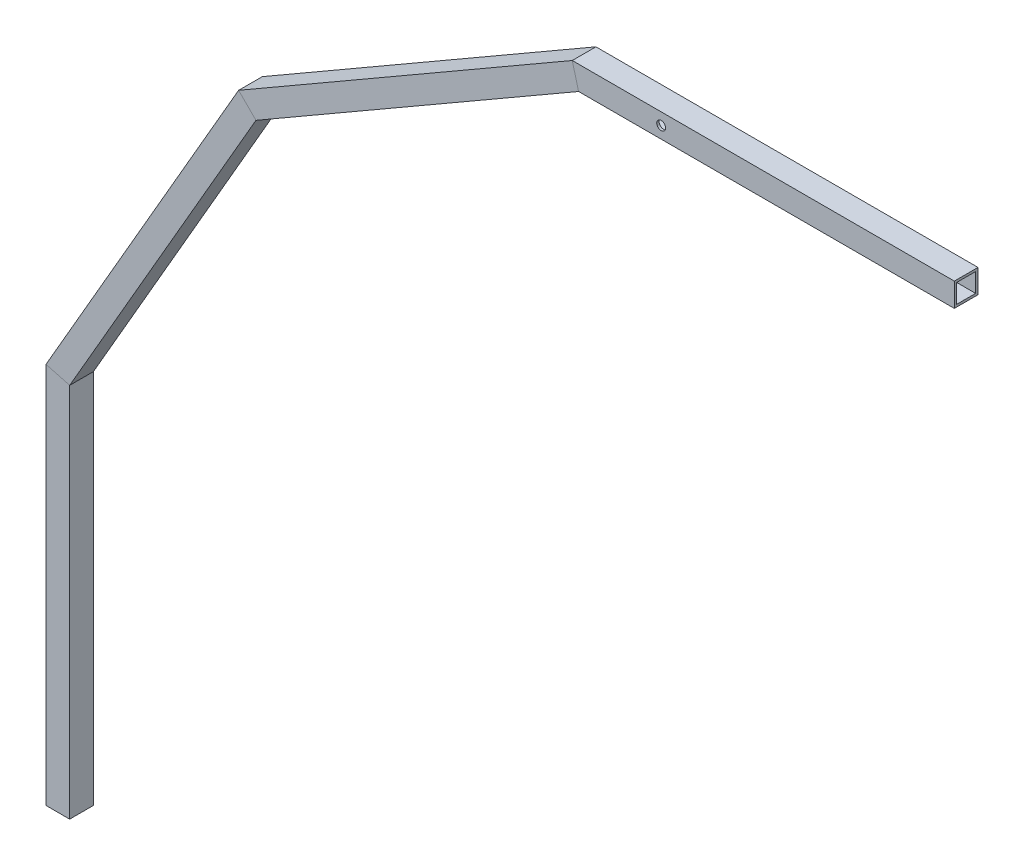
ISO-10303-21;
HEADER;
FILE_DESCRIPTION(('STEP AP214'),'2;1');
FILE_NAME('part.step','',(''),(''),'','','');
FILE_SCHEMA(('AUTOMOTIVE_DESIGN { 1 0 10303 214 1 1 1 1 }'));
ENDSEC;
DATA;
#1=APPLICATION_CONTEXT('core data for automotive mechanical design processes');
#2=APPLICATION_PROTOCOL_DEFINITION('international standard','automotive_design',2000,#1);
#3=PRODUCT_CONTEXT('',#1,'mechanical');
#4=PRODUCT('Part','Part','',(#3));
#5=PRODUCT_RELATED_PRODUCT_CATEGORY('part','',(#4));
#6=PRODUCT_DEFINITION_FORMATION('','',#4);
#7=PRODUCT_DEFINITION_CONTEXT('part definition',#1,'design');
#8=PRODUCT_DEFINITION('design','',#6,#7);
#9=PRODUCT_DEFINITION_SHAPE('','',#8);
#10=(LENGTH_UNIT() NAMED_UNIT(*) SI_UNIT(.MILLI.,.METRE.));
#11=(NAMED_UNIT(*) PLANE_ANGLE_UNIT() SI_UNIT($,.RADIAN.));
#12=(NAMED_UNIT(*) SI_UNIT($,.STERADIAN.) SOLID_ANGLE_UNIT());
#13=UNCERTAINTY_MEASURE_WITH_UNIT(LENGTH_MEASURE(1.E-05),#10,'distance_accuracy_value','');
#14=(GEOMETRIC_REPRESENTATION_CONTEXT(3) GLOBAL_UNCERTAINTY_ASSIGNED_CONTEXT((#13)) GLOBAL_UNIT_ASSIGNED_CONTEXT((#10,
#11,#12)) REPRESENTATION_CONTEXT('',''));
#15=CARTESIAN_POINT('',(0.,0.,0.));
#16=DIRECTION('',(0.,0.,1.));
#17=DIRECTION('',(1.,0.,0.));
#18=AXIS2_PLACEMENT_3D('',#15,#16,#17);
#19=CARTESIAN_POINT('',(551.309473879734,974.252724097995,-12.7));
#20=DIRECTION('',(0.,1.,0.));
#21=DIRECTION('',(-1.,0.,0.));
#22=AXIS2_PLACEMENT_3D('',#19,#20,#21);
#23=PLANE('',#22);
#24=DIRECTION('',(0.,0.,-1.));
#25=VECTOR('',#24,1.);
#26=CARTESIAN_POINT('',(551.749769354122,974.252724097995,-12.7));
#27=LINE('',#26,#25);
#28=CARTESIAN_POINT('',(551.749769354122,974.252724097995,12.7));
#29=VERTEX_POINT('',#28);
#30=CARTESIAN_POINT('',(551.749769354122,974.252724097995,-12.7));
#31=VERTEX_POINT('',#30);
#32=EDGE_CURVE('E200',#29,#31,#27,.T.);
#33=ORIENTED_EDGE('',*,*,#32,.F.);
#34=DIRECTION('',(1.,0.,0.));
#35=VECTOR('',#34,1.);
#36=CARTESIAN_POINT('',(551.309473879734,974.252724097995,12.7));
#37=LINE('',#36,#35);
#38=CARTESIAN_POINT('',(961.552724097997,974.252724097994,12.7));
#39=VERTEX_POINT('',#38);
#40=EDGE_CURVE('E165',#29,#39,#37,.T.);
#41=ORIENTED_EDGE('',*,*,#40,.T.);
#42=DIRECTION('',(0.,0.,1.));
#43=VECTOR('',#42,1.);
#44=CARTESIAN_POINT('',(961.552724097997,974.252724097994,-12.7));
#45=LINE('',#44,#43);
#46=CARTESIAN_POINT('',(961.552724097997,974.252724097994,-12.7));
#47=VERTEX_POINT('',#46);
#48=EDGE_CURVE('E216',#47,#39,#45,.T.);
#49=ORIENTED_EDGE('',*,*,#48,.F.);
#50=DIRECTION('',(1.,0.,0.));
#51=VECTOR('',#50,1.);
#52=CARTESIAN_POINT('',(551.309473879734,974.252724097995,-12.7));
#53=LINE('',#52,#51);
#54=EDGE_CURVE('E194',#31,#47,#53,.T.);
#55=ORIENTED_EDGE('',*,*,#54,.F.);
#56=EDGE_LOOP('',(#33,#41,#49,#55));
#57=FACE_BOUND('',#56,.T.);
#58=ADVANCED_FACE('F33',(#57),#23,.T.);
#59=CARTESIAN_POINT('',(551.309473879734,948.852724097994,12.7));
#60=DIRECTION('',(0.,0.,1.));
#61=DIRECTION('',(0.,-1.,0.));
#62=AXIS2_PLACEMENT_3D('',#59,#60,#61);
#63=PLANE('',#62);
#64=CARTESIAN_POINT('',(647.126769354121,961.552724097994,12.6999999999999));
#65=DIRECTION('',(0.,0.,1.));
#66=DIRECTION('',(1.,0.,0.));
#67=AXIS2_PLACEMENT_3D('',#64,#65,#66);
#68=CIRCLE('',#67,4.76250000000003);
#69=CARTESIAN_POINT('',(651.889269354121,961.552724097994,12.6999999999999));
#70=VERTEX_POINT('',#69);
#71=EDGE_CURVE('E401',#70,#70,#68,.T.);
#72=ORIENTED_EDGE('',*,*,#71,.F.);
#73=EDGE_LOOP('',(#72));
#74=FACE_BOUND('',#73,.T.);
#75=DIRECTION('',(-0.258819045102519,0.965925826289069,0.));
#76=VECTOR('',#75,1.);
#77=CARTESIAN_POINT('',(585.808810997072,847.142650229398,12.7));
#78=LINE('',#77,#76);
#79=CARTESIAN_POINT('',(558.555678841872,948.852724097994,12.7));
#80=VERTEX_POINT('',#79);
#81=EDGE_CURVE('E160',#80,#29,#78,.T.);
#82=ORIENTED_EDGE('',*,*,#81,.F.);
#83=DIRECTION('',(1.,0.,0.));
#84=VECTOR('',#83,1.);
#85=CARTESIAN_POINT('',(551.309473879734,948.852724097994,12.7));
#86=LINE('',#85,#84);
#87=CARTESIAN_POINT('',(961.552724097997,948.852724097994,12.7));
#88=VERTEX_POINT('',#87);
#89=EDGE_CURVE('E162',#80,#88,#86,.T.);
#90=ORIENTED_EDGE('',*,*,#89,.T.);
#91=DIRECTION('',(0.,-1.,0.));
#92=VECTOR('',#91,1.);
#93=CARTESIAN_POINT('',(961.552724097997,948.852724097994,12.7));
#94=LINE('',#93,#92);
#95=EDGE_CURVE('E221',#39,#88,#94,.T.);
#96=ORIENTED_EDGE('',*,*,#95,.F.);
#97=ORIENTED_EDGE('',*,*,#40,.F.);
#98=EDGE_LOOP('',(#82,#90,#96,#97));
#99=FACE_BOUND('',#98,.T.);
#100=ADVANCED_FACE('F161',(#74,#99),#63,.T.);
#101=CARTESIAN_POINT('',(551.309473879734,948.852724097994,-12.7));
#102=DIRECTION('',(0.,-1.,0.));
#103=DIRECTION('',(1.,0.,0.));
#104=AXIS2_PLACEMENT_3D('',#101,#102,#103);
#105=PLANE('',#104);
#106=DIRECTION('',(0.,0.,1.));
#107=VECTOR('',#106,1.);
#108=CARTESIAN_POINT('',(558.555678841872,948.852724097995,-12.7));
#109=LINE('',#108,#107);
#110=CARTESIAN_POINT('',(558.555678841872,948.852724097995,-12.7));
#111=VERTEX_POINT('',#110);
#112=EDGE_CURVE('E153',#111,#80,#109,.T.);
#113=ORIENTED_EDGE('',*,*,#112,.F.);
#114=DIRECTION('',(1.,0.,0.));
#115=VECTOR('',#114,1.);
#116=CARTESIAN_POINT('',(551.309473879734,948.852724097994,-12.7));
#117=LINE('',#116,#115);
#118=CARTESIAN_POINT('',(961.552724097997,948.852724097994,-12.7));
#119=VERTEX_POINT('',#118);
#120=EDGE_CURVE('E175',#111,#119,#117,.T.);
#121=ORIENTED_EDGE('',*,*,#120,.T.);
#122=DIRECTION('',(0.,0.,-1.));
#123=VECTOR('',#122,1.);
#124=CARTESIAN_POINT('',(961.552724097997,948.852724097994,-12.7));
#125=LINE('',#124,#123);
#126=EDGE_CURVE('E174',#88,#119,#125,.T.);
#127=ORIENTED_EDGE('',*,*,#126,.F.);
#128=ORIENTED_EDGE('',*,*,#89,.F.);
#129=EDGE_LOOP('',(#113,#121,#127,#128));
#130=FACE_BOUND('',#129,.T.);
#131=ADVANCED_FACE('F172',(#130),#105,.T.);
#132=CARTESIAN_POINT('',(551.309473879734,948.852724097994,-12.7));
#133=DIRECTION('',(0.,0.,-1.));
#134=DIRECTION('',(0.,1.,0.));
#135=AXIS2_PLACEMENT_3D('',#132,#133,#134);
#136=PLANE('',#135);
#137=CARTESIAN_POINT('',(647.126769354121,961.552724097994,-12.7));
#138=DIRECTION('',(0.,0.,1.));
#139=DIRECTION('',(1.,0.,0.));
#140=AXIS2_PLACEMENT_3D('',#137,#138,#139);
#141=CIRCLE('',#140,4.76250000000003);
#142=CARTESIAN_POINT('',(651.889269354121,961.552724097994,-12.7));
#143=VERTEX_POINT('',#142);
#144=EDGE_CURVE('E404',#143,#143,#141,.T.);
#145=ORIENTED_EDGE('',*,*,#144,.T.);
#146=EDGE_LOOP('',(#145));
#147=FACE_BOUND('',#146,.T.);
#148=DIRECTION('',(0.258819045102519,-0.965925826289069,0.));
#149=VECTOR('',#148,1.);
#150=CARTESIAN_POINT('',(585.808810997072,847.142650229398,-12.7));
#151=LINE('',#150,#149);
#152=EDGE_CURVE('E185',#31,#111,#151,.T.);
#153=ORIENTED_EDGE('',*,*,#152,.F.);
#154=ORIENTED_EDGE('',*,*,#54,.T.);
#155=DIRECTION('',(0.,1.,0.));
#156=VECTOR('',#155,1.);
#157=CARTESIAN_POINT('',(961.552724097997,948.852724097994,-12.7));
#158=LINE('',#157,#156);
#159=EDGE_CURVE('E209',#119,#47,#158,.T.);
#160=ORIENTED_EDGE('',*,*,#159,.F.);
#161=ORIENTED_EDGE('',*,*,#120,.F.);
#162=EDGE_LOOP('',(#153,#154,#160,#161));
#163=FACE_BOUND('',#162,.T.);
#164=ADVANCED_FACE('F35',(#147,#163),#136,.T.);
#165=CARTESIAN_POINT('',(206.221647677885,745.432576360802,-12.7));
#166=DIRECTION('',(0.,0.,-1.));
#167=DIRECTION('',(0.,1.,0.));
#168=AXIS2_PLACEMENT_3D('',#165,#166,#167);
#169=PLANE('',#168);
#170=DIRECTION('',(0.86602540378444,0.499999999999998,0.));
#171=VECTOR('',#170,1.);
#172=CARTESIAN_POINT('',(193.521647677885,767.429621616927,-12.7));
#173=LINE('',#172,#171);
#174=CARTESIAN_POINT('',(193.902954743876,767.64976935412,-12.7));
#175=VERTEX_POINT('',#174);
#176=EDGE_CURVE('E192',#175,#31,#173,.T.);
#177=ORIENTED_EDGE('',*,*,#176,.T.);
#178=ORIENTED_EDGE('',*,*,#152,.T.);
#179=DIRECTION('',(0.86602540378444,0.499999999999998,0.));
#180=VECTOR('',#179,1.);
#181=CARTESIAN_POINT('',(206.221647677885,745.432576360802,-12.7));
#182=LINE('',#181,#180);
#183=CARTESIAN_POINT('',(212.497045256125,749.055678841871,-12.7));
#184=VERTEX_POINT('',#183);
#185=EDGE_CURVE('E184',#184,#111,#182,.T.);
#186=ORIENTED_EDGE('',*,*,#185,.F.);
#187=DIRECTION('',(0.707106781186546,-0.707106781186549,0.));
#188=VECTOR('',#187,1.);
#189=CARTESIAN_POINT('',(286.953986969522,674.598737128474,-12.7));
#190=LINE('',#189,#188);
#191=EDGE_CURVE('E256',#175,#184,#190,.T.);
#192=ORIENTED_EDGE('',*,*,#191,.F.);
#193=EDGE_LOOP('',(#177,#178,#186,#192));
#194=FACE_BOUND('',#193,.T.);
#195=ADVANCED_FACE('F273',(#194),#169,.T.);
#196=CARTESIAN_POINT('',(206.221647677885,745.432576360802,-12.7));
#197=DIRECTION('',(0.499999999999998,-0.86602540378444,0.));
#198=DIRECTION('',(0.86602540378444,0.499999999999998,0.));
#199=AXIS2_PLACEMENT_3D('',#196,#197,#198);
#200=PLANE('',#199);
#201=ORIENTED_EDGE('',*,*,#185,.T.);
#202=ORIENTED_EDGE('',*,*,#112,.T.);
#203=DIRECTION('',(0.86602540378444,0.499999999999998,0.));
#204=VECTOR('',#203,1.);
#205=CARTESIAN_POINT('',(206.221647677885,745.432576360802,12.7));
#206=LINE('',#205,#204);
#207=CARTESIAN_POINT('',(212.497045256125,749.055678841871,12.7));
#208=VERTEX_POINT('',#207);
#209=EDGE_CURVE('E181',#208,#80,#206,.T.);
#210=ORIENTED_EDGE('',*,*,#209,.F.);
#211=DIRECTION('',(0.,0.,1.));
#212=VECTOR('',#211,1.);
#213=CARTESIAN_POINT('',(212.497045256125,749.055678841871,-12.7));
#214=LINE('',#213,#212);
#215=EDGE_CURVE('E254',#184,#208,#214,.T.);
#216=ORIENTED_EDGE('',*,*,#215,.F.);
#217=EDGE_LOOP('',(#201,#202,#210,#216));
#218=FACE_BOUND('',#217,.T.);
#219=ADVANCED_FACE('F180',(#218),#200,.T.);
#220=CARTESIAN_POINT('',(206.221647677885,745.432576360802,12.7));
#221=DIRECTION('',(0.,0.,1.));
#222=DIRECTION('',(0.,-1.,0.));
#223=AXIS2_PLACEMENT_3D('',#220,#221,#222);
#224=PLANE('',#223);
#225=ORIENTED_EDGE('',*,*,#209,.T.);
#226=ORIENTED_EDGE('',*,*,#81,.T.);
#227=DIRECTION('',(0.86602540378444,0.499999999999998,0.));
#228=VECTOR('',#227,1.);
#229=CARTESIAN_POINT('',(193.521647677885,767.429621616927,12.7));
#230=LINE('',#229,#228);
#231=CARTESIAN_POINT('',(193.902954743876,767.64976935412,12.7));
#232=VERTEX_POINT('',#231);
#233=EDGE_CURVE('E190',#232,#29,#230,.T.);
#234=ORIENTED_EDGE('',*,*,#233,.F.);
#235=DIRECTION('',(-0.707106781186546,0.707106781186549,0.));
#236=VECTOR('',#235,1.);
#237=CARTESIAN_POINT('',(286.953986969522,674.598737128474,12.7));
#238=LINE('',#237,#236);
#239=EDGE_CURVE('E189',#208,#232,#238,.T.);
#240=ORIENTED_EDGE('',*,*,#239,.F.);
#241=EDGE_LOOP('',(#225,#226,#234,#240));
#242=FACE_BOUND('',#241,.T.);
#243=ADVANCED_FACE('F187',(#242),#224,.T.);
#244=CARTESIAN_POINT('',(193.521647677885,767.429621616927,-12.7));
#245=DIRECTION('',(-0.499999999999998,0.86602540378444,0.));
#246=DIRECTION('',(-0.86602540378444,-0.499999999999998,0.));
#247=AXIS2_PLACEMENT_3D('',#244,#245,#246);
#248=PLANE('',#247);
#249=ORIENTED_EDGE('',*,*,#233,.T.);
#250=ORIENTED_EDGE('',*,*,#32,.T.);
#251=ORIENTED_EDGE('',*,*,#176,.F.);
#252=DIRECTION('',(0.,0.,-1.));
#253=VECTOR('',#252,1.);
#254=CARTESIAN_POINT('',(193.902954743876,767.64976935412,-12.7));
#255=LINE('',#254,#253);
#256=EDGE_CURVE('E259',#232,#175,#255,.T.);
#257=ORIENTED_EDGE('',*,*,#256,.F.);
#258=EDGE_LOOP('',(#249,#250,#251,#257));
#259=FACE_BOUND('',#258,.T.);
#260=ADVANCED_FACE('F276',(#259),#248,.T.);
#261=CARTESIAN_POINT('',(9.07689751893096,396.721647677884,-12.7));
#262=DIRECTION('',(0.,0.,-1.));
#263=DIRECTION('',(-1.,0.,0.));
#264=AXIS2_PLACEMENT_3D('',#261,#262,#263);
#265=PLANE('',#264);
#266=DIRECTION('',(0.500000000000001,0.866025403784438,0.));
#267=VECTOR('',#266,1.);
#268=CARTESIAN_POINT('',(-12.9201477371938,409.421647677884,-12.7));
#269=LINE('',#268,#267);
#270=CARTESIAN_POINT('',(-12.7,409.802954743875,-12.7));
#271=VERTEX_POINT('',#270);
#272=EDGE_CURVE('E268',#271,#175,#269,.T.);
#273=ORIENTED_EDGE('',*,*,#272,.T.);
#274=ORIENTED_EDGE('',*,*,#191,.T.);
#275=DIRECTION('',(0.500000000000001,0.866025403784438,0.));
#276=VECTOR('',#275,1.);
#277=CARTESIAN_POINT('',(9.07689751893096,396.721647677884,-12.7));
#278=LINE('',#277,#276);
#279=CARTESIAN_POINT('',(12.7,402.997045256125,-12.7));
#280=VERTEX_POINT('',#279);
#281=EDGE_CURVE('E170',#280,#184,#278,.T.);
#282=ORIENTED_EDGE('',*,*,#281,.F.);
#283=DIRECTION('',(0.965925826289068,-0.258819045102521,0.));
#284=VECTOR('',#283,1.);
#285=CARTESIAN_POINT('',(113.449261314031,376.001362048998,-12.7));
#286=LINE('',#285,#284);
#287=EDGE_CURVE('E235',#271,#280,#286,.T.);
#288=ORIENTED_EDGE('',*,*,#287,.F.);
#289=EDGE_LOOP('',(#273,#274,#282,#288));
#290=FACE_BOUND('',#289,.T.);
#291=ADVANCED_FACE('F282',(#290),#265,.T.);
#292=CARTESIAN_POINT('',(9.07689751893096,396.721647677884,-12.7));
#293=DIRECTION('',(0.866025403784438,-0.500000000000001,0.));
#294=DIRECTION('',(0.500000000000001,0.866025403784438,0.));
#295=AXIS2_PLACEMENT_3D('',#292,#293,#294);
#296=PLANE('',#295);
#297=ORIENTED_EDGE('',*,*,#281,.T.);
#298=ORIENTED_EDGE('',*,*,#215,.T.);
#299=DIRECTION('',(0.500000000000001,0.866025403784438,0.));
#300=VECTOR('',#299,1.);
#301=CARTESIAN_POINT('',(9.07689751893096,396.721647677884,12.7));
#302=LINE('',#301,#300);
#303=CARTESIAN_POINT('',(12.7,402.997045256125,12.7));
#304=VERTEX_POINT('',#303);
#305=EDGE_CURVE('E262',#304,#208,#302,.T.);
#306=ORIENTED_EDGE('',*,*,#305,.F.);
#307=DIRECTION('',(0.,0.,1.));
#308=VECTOR('',#307,1.);
#309=CARTESIAN_POINT('',(12.7,402.997045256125,-12.7));
#310=LINE('',#309,#308);
#311=EDGE_CURVE('E232',#280,#304,#310,.T.);
#312=ORIENTED_EDGE('',*,*,#311,.F.);
#313=EDGE_LOOP('',(#297,#298,#306,#312));
#314=FACE_BOUND('',#313,.T.);
#315=ADVANCED_FACE('F533',(#314),#296,.T.);
#316=CARTESIAN_POINT('',(9.07689751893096,396.721647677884,12.7));
#317=DIRECTION('',(0.,0.,1.));
#318=DIRECTION('',(1.,0.,0.));
#319=AXIS2_PLACEMENT_3D('',#316,#317,#318);
#320=PLANE('',#319);
#321=ORIENTED_EDGE('',*,*,#305,.T.);
#322=ORIENTED_EDGE('',*,*,#239,.T.);
#323=DIRECTION('',(0.500000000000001,0.866025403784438,0.));
#324=VECTOR('',#323,1.);
#325=CARTESIAN_POINT('',(-12.9201477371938,409.421647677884,12.7));
#326=LINE('',#325,#324);
#327=CARTESIAN_POINT('',(-12.7,409.802954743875,12.7));
#328=VERTEX_POINT('',#327);
#329=EDGE_CURVE('E265',#328,#232,#326,.T.);
#330=ORIENTED_EDGE('',*,*,#329,.F.);
#331=DIRECTION('',(-0.965925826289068,0.258819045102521,0.));
#332=VECTOR('',#331,1.);
#333=CARTESIAN_POINT('',(113.449261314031,376.001362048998,12.7));
#334=LINE('',#333,#332);
#335=EDGE_CURVE('E228',#304,#328,#334,.T.);
#336=ORIENTED_EDGE('',*,*,#335,.F.);
#337=EDGE_LOOP('',(#321,#322,#330,#336));
#338=FACE_BOUND('',#337,.T.);
#339=ADVANCED_FACE('F530',(#338),#320,.T.);
#340=CARTESIAN_POINT('',(-12.9201477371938,409.421647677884,-12.7));
#341=DIRECTION('',(-0.866025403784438,0.500000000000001,0.));
#342=DIRECTION('',(-0.500000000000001,-0.866025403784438,0.));
#343=AXIS2_PLACEMENT_3D('',#340,#341,#342);
#344=PLANE('',#343);
#345=ORIENTED_EDGE('',*,*,#329,.T.);
#346=ORIENTED_EDGE('',*,*,#256,.T.);
#347=ORIENTED_EDGE('',*,*,#272,.F.);
#348=DIRECTION('',(0.,0.,-1.));
#349=VECTOR('',#348,1.);
#350=CARTESIAN_POINT('',(-12.7,409.802954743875,-12.7));
#351=LINE('',#350,#349);
#352=EDGE_CURVE('E238',#328,#271,#351,.T.);
#353=ORIENTED_EDGE('',*,*,#352,.F.);
#354=EDGE_LOOP('',(#345,#346,#347,#353));
#355=FACE_BOUND('',#354,.T.);
#356=ADVANCED_FACE('F279',(#355),#344,.T.);
#357=CARTESIAN_POINT('',(12.7,0.,-12.7));
#358=DIRECTION('',(0.,0.,-1.));
#359=DIRECTION('',(-1.,0.,0.));
#360=AXIS2_PLACEMENT_3D('',#357,#358,#359);
#361=PLANE('',#360);
#362=DIRECTION('',(0.,1.,0.));
#363=VECTOR('',#362,1.);
#364=CARTESIAN_POINT('',(-12.7,0.,-12.7));
#365=LINE('',#364,#363);
#366=CARTESIAN_POINT('',(-12.7,0.,-12.7));
#367=VERTEX_POINT('',#366);
#368=EDGE_CURVE('E243',#367,#271,#365,.T.);
#369=ORIENTED_EDGE('',*,*,#368,.T.);
#370=ORIENTED_EDGE('',*,*,#287,.T.);
#371=DIRECTION('',(0.,1.,0.));
#372=VECTOR('',#371,1.);
#373=CARTESIAN_POINT('',(12.7,0.,-12.7));
#374=LINE('',#373,#372);
#375=CARTESIAN_POINT('',(12.7,0.,-12.7));
#376=VERTEX_POINT('',#375);
#377=EDGE_CURVE('E248',#376,#280,#374,.T.);
#378=ORIENTED_EDGE('',*,*,#377,.F.);
#379=DIRECTION('',(-1.,0.,0.));
#380=VECTOR('',#379,1.);
#381=CARTESIAN_POINT('',(12.7,0.,-12.7));
#382=LINE('',#381,#380);
#383=EDGE_CURVE('E295',#376,#367,#382,.T.);
#384=ORIENTED_EDGE('',*,*,#383,.T.);
#385=EDGE_LOOP('',(#369,#370,#378,#384));
#386=FACE_BOUND('',#385,.T.);
#387=ADVANCED_FACE('F286',(#386),#361,.T.);
#388=CARTESIAN_POINT('',(12.7,0.,-12.7));
#389=DIRECTION('',(1.,0.,0.));
#390=DIRECTION('',(0.,0.,-1.));
#391=AXIS2_PLACEMENT_3D('',#388,#389,#390);
#392=PLANE('',#391);
#393=ORIENTED_EDGE('',*,*,#377,.T.);
#394=ORIENTED_EDGE('',*,*,#311,.T.);
#395=DIRECTION('',(0.,1.,0.));
#396=VECTOR('',#395,1.);
#397=CARTESIAN_POINT('',(12.7,0.,12.7));
#398=LINE('',#397,#396);
#399=CARTESIAN_POINT('',(12.7,0.,12.7));
#400=VERTEX_POINT('',#399);
#401=EDGE_CURVE('E242',#400,#304,#398,.T.);
#402=ORIENTED_EDGE('',*,*,#401,.F.);
#403=DIRECTION('',(0.,0.,-1.));
#404=VECTOR('',#403,1.);
#405=CARTESIAN_POINT('',(12.7,0.,-12.7));
#406=LINE('',#405,#404);
#407=EDGE_CURVE('E225',#400,#376,#406,.T.);
#408=ORIENTED_EDGE('',*,*,#407,.T.);
#409=EDGE_LOOP('',(#393,#394,#402,#408));
#410=FACE_BOUND('',#409,.T.);
#411=ADVANCED_FACE('F290',(#410),#392,.T.);
#412=CARTESIAN_POINT('',(12.7,0.,12.7));
#413=DIRECTION('',(0.,0.,1.));
#414=DIRECTION('',(1.,0.,0.));
#415=AXIS2_PLACEMENT_3D('',#412,#413,#414);
#416=PLANE('',#415);
#417=ORIENTED_EDGE('',*,*,#401,.T.);
#418=ORIENTED_EDGE('',*,*,#335,.T.);
#419=DIRECTION('',(0.,1.,0.));
#420=VECTOR('',#419,1.);
#421=CARTESIAN_POINT('',(-12.7,0.,12.7));
#422=LINE('',#421,#420);
#423=CARTESIAN_POINT('',(-12.7,0.,12.7));
#424=VERTEX_POINT('',#423);
#425=EDGE_CURVE('E239',#424,#328,#422,.T.);
#426=ORIENTED_EDGE('',*,*,#425,.F.);
#427=DIRECTION('',(1.,0.,0.));
#428=VECTOR('',#427,1.);
#429=CARTESIAN_POINT('',(12.7,0.,12.7));
#430=LINE('',#429,#428);
#431=EDGE_CURVE('E219',#424,#400,#430,.T.);
#432=ORIENTED_EDGE('',*,*,#431,.T.);
#433=EDGE_LOOP('',(#417,#418,#426,#432));
#434=FACE_BOUND('',#433,.T.);
#435=ADVANCED_FACE('F520',(#434),#416,.T.);
#436=CARTESIAN_POINT('',(-12.7,0.,-12.7));
#437=DIRECTION('',(-1.,0.,0.));
#438=DIRECTION('',(0.,0.,1.));
#439=AXIS2_PLACEMENT_3D('',#436,#437,#438);
#440=PLANE('',#439);
#441=ORIENTED_EDGE('',*,*,#425,.T.);
#442=ORIENTED_EDGE('',*,*,#352,.T.);
#443=ORIENTED_EDGE('',*,*,#368,.F.);
#444=DIRECTION('',(0.,0.,1.));
#445=VECTOR('',#444,1.);
#446=CARTESIAN_POINT('',(-12.7,0.,-12.7));
#447=LINE('',#446,#445);
#448=EDGE_CURVE('E217',#367,#424,#447,.T.);
#449=ORIENTED_EDGE('',*,*,#448,.T.);
#450=EDGE_LOOP('',(#441,#442,#443,#449));
#451=FACE_BOUND('',#450,.T.);
#452=ADVANCED_FACE('F517',(#451),#440,.T.);
#453=CARTESIAN_POINT('',(961.552724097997,961.552724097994,0.));
#454=DIRECTION('',(-1.,0.,0.));
#455=DIRECTION('',(0.,0.,-1.));
#456=AXIS2_PLACEMENT_3D('',#453,#454,#455);
#457=PLANE('',#456);
#458=ORIENTED_EDGE('',*,*,#48,.T.);
#459=ORIENTED_EDGE('',*,*,#95,.T.);
#460=ORIENTED_EDGE('',*,*,#126,.T.);
#461=ORIENTED_EDGE('',*,*,#159,.T.);
#462=EDGE_LOOP('',(#458,#459,#460,#461));
#463=FACE_BOUND('',#462,.T.);
#464=DIRECTION('',(0.,0.,-1.));
#465=VECTOR('',#464,1.);
#466=CARTESIAN_POINT('',(961.552724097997,951.392724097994,-10.16));
#467=LINE('',#466,#465);
#468=CARTESIAN_POINT('',(961.552724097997,951.392724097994,-10.16));
#469=VERTEX_POINT('',#468);
#470=CARTESIAN_POINT('',(961.552724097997,951.392724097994,10.16));
#471=VERTEX_POINT('',#470);
#472=EDGE_CURVE('E296',#469,#471,#467,.F.);
#473=ORIENTED_EDGE('',*,*,#472,.T.);
#474=DIRECTION('',(0.,-1.,0.));
#475=VECTOR('',#474,1.);
#476=CARTESIAN_POINT('',(961.552724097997,951.392724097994,10.16));
#477=LINE('',#476,#475);
#478=CARTESIAN_POINT('',(961.552724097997,971.712724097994,10.16));
#479=VERTEX_POINT('',#478);
#480=EDGE_CURVE('E314',#471,#479,#477,.F.);
#481=ORIENTED_EDGE('',*,*,#480,.T.);
#482=DIRECTION('',(0.,0.,1.));
#483=VECTOR('',#482,1.);
#484=CARTESIAN_POINT('',(961.552724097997,971.712724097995,-10.16));
#485=LINE('',#484,#483);
#486=CARTESIAN_POINT('',(961.552724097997,971.712724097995,-10.16));
#487=VERTEX_POINT('',#486);
#488=EDGE_CURVE('E316',#479,#487,#485,.F.);
#489=ORIENTED_EDGE('',*,*,#488,.T.);
#490=DIRECTION('',(0.,1.,0.));
#491=VECTOR('',#490,1.);
#492=CARTESIAN_POINT('',(961.552724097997,951.392724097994,-10.16));
#493=LINE('',#492,#491);
#494=EDGE_CURVE('E318',#487,#469,#493,.F.);
#495=ORIENTED_EDGE('',*,*,#494,.T.);
#496=EDGE_LOOP('',(#473,#481,#489,#495));
#497=FACE_BOUND('',#496,.T.);
#498=ADVANCED_FACE('F214',(#463,#497),#457,.F.);
#499=CARTESIAN_POINT('',(0.,0.,0.));
#500=DIRECTION('',(0.,-1.,0.));
#501=DIRECTION('',(0.,0.,-1.));
#502=AXIS2_PLACEMENT_3D('',#499,#500,#501);
#503=PLANE('',#502);
#504=ORIENTED_EDGE('',*,*,#448,.F.);
#505=ORIENTED_EDGE('',*,*,#383,.F.);
#506=ORIENTED_EDGE('',*,*,#407,.F.);
#507=ORIENTED_EDGE('',*,*,#431,.F.);
#508=EDGE_LOOP('',(#504,#505,#506,#507));
#509=FACE_BOUND('',#508,.T.);
#510=DIRECTION('',(0.,0.,-1.));
#511=VECTOR('',#510,1.);
#512=CARTESIAN_POINT('',(10.16,0.,-10.16));
#513=LINE('',#512,#511);
#514=CARTESIAN_POINT('',(10.16,0.,-10.16));
#515=VERTEX_POINT('',#514);
#516=CARTESIAN_POINT('',(10.16,0.,10.16));
#517=VERTEX_POINT('',#516);
#518=EDGE_CURVE('E373',#515,#517,#513,.F.);
#519=ORIENTED_EDGE('',*,*,#518,.F.);
#520=DIRECTION('',(-1.,0.,0.));
#521=VECTOR('',#520,1.);
#522=CARTESIAN_POINT('',(10.16,0.,-10.16));
#523=LINE('',#522,#521);
#524=CARTESIAN_POINT('',(-10.16,0.,-10.16));
#525=VERTEX_POINT('',#524);
#526=EDGE_CURVE('E377',#525,#515,#523,.F.);
#527=ORIENTED_EDGE('',*,*,#526,.F.);
#528=DIRECTION('',(0.,0.,1.));
#529=VECTOR('',#528,1.);
#530=CARTESIAN_POINT('',(-10.16,0.,-10.16));
#531=LINE('',#530,#529);
#532=CARTESIAN_POINT('',(-10.16,0.,10.16));
#533=VERTEX_POINT('',#532);
#534=EDGE_CURVE('E383',#533,#525,#531,.F.);
#535=ORIENTED_EDGE('',*,*,#534,.F.);
#536=DIRECTION('',(1.,0.,0.));
#537=VECTOR('',#536,1.);
#538=CARTESIAN_POINT('',(10.16,0.,10.16));
#539=LINE('',#538,#537);
#540=EDGE_CURVE('E367',#517,#533,#539,.F.);
#541=ORIENTED_EDGE('',*,*,#540,.F.);
#542=EDGE_LOOP('',(#519,#527,#535,#541));
#543=FACE_BOUND('',#542,.T.);
#544=ADVANCED_FACE('F460',(#509,#543),#503,.T.);
#545=CARTESIAN_POINT('',(552.058123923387,951.392724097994,10.16));
#546=DIRECTION('',(0.,0.,-1.));
#547=DIRECTION('',(0.,1.,0.));
#548=AXIS2_PLACEMENT_3D('',#545,#546,#547);
#549=PLANE('',#548);
#550=CARTESIAN_POINT('',(647.126769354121,961.552724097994,10.16));
#551=DIRECTION('',(0.,0.,-1.));
#552=DIRECTION('',(0.,1.,0.));
#553=AXIS2_PLACEMENT_3D('',#550,#551,#552);
#554=CIRCLE('',#553,4.76250000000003);
#555=CARTESIAN_POINT('',(651.889269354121,961.552724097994,10.16));
#556=VERTEX_POINT('',#555);
#557=EDGE_CURVE('E203',#556,#556,#554,.T.);
#558=ORIENTED_EDGE('',*,*,#557,.F.);
#559=EDGE_LOOP('',(#558));
#560=FACE_BOUND('',#559,.T.);
#561=DIRECTION('',(0.258819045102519,-0.965925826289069,0.));
#562=VECTOR('',#561,1.);
#563=CARTESIAN_POINT('',(585.12366095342,849.699665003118,10.16));
#564=LINE('',#563,#562);
#565=CARTESIAN_POINT('',(552.430360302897,971.712724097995,10.16));
#566=VERTEX_POINT('',#565);
#567=CARTESIAN_POINT('',(557.875087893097,951.392724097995,10.16));
#568=VERTEX_POINT('',#567);
#569=EDGE_CURVE('E321',#566,#568,#564,.T.);
#570=ORIENTED_EDGE('',*,*,#569,.F.);
#571=DIRECTION('',(1.,0.,0.));
#572=VECTOR('',#571,1.);
#573=CARTESIAN_POINT('',(552.058123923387,971.712724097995,10.16));
#574=LINE('',#573,#572);
#575=EDGE_CURVE('E305',#566,#479,#574,.T.);
#576=ORIENTED_EDGE('',*,*,#575,.T.);
#577=ORIENTED_EDGE('',*,*,#480,.F.);
#578=DIRECTION('',(1.,0.,0.));
#579=VECTOR('',#578,1.);
#580=CARTESIAN_POINT('',(552.058123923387,951.392724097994,10.16));
#581=LINE('',#580,#579);
#582=EDGE_CURVE('E301',#568,#471,#581,.T.);
#583=ORIENTED_EDGE('',*,*,#582,.F.);
#584=EDGE_LOOP('',(#570,#576,#577,#583));
#585=FACE_BOUND('',#584,.T.);
#586=ADVANCED_FACE('F504',(#560,#585),#549,.T.);
#587=CARTESIAN_POINT('',(552.058123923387,971.712724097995,-10.16));
#588=DIRECTION('',(0.,-1.,0.));
#589=DIRECTION('',(1.,0.,0.));
#590=AXIS2_PLACEMENT_3D('',#587,#588,#589);
#591=PLANE('',#590);
#592=DIRECTION('',(0.,0.,1.));
#593=VECTOR('',#592,1.);
#594=CARTESIAN_POINT('',(552.430360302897,971.712724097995,-10.16));
#595=LINE('',#594,#593);
#596=CARTESIAN_POINT('',(552.430360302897,971.712724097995,-10.16));
#597=VERTEX_POINT('',#596);
#598=EDGE_CURVE('E341',#597,#566,#595,.T.);
#599=ORIENTED_EDGE('',*,*,#598,.F.);
#600=DIRECTION('',(1.,0.,0.));
#601=VECTOR('',#600,1.);
#602=CARTESIAN_POINT('',(552.058123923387,971.712724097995,-10.16));
#603=LINE('',#602,#601);
#604=EDGE_CURVE('E308',#597,#487,#603,.T.);
#605=ORIENTED_EDGE('',*,*,#604,.T.);
#606=ORIENTED_EDGE('',*,*,#488,.F.);
#607=ORIENTED_EDGE('',*,*,#575,.F.);
#608=EDGE_LOOP('',(#599,#605,#606,#607));
#609=FACE_BOUND('',#608,.T.);
#610=ADVANCED_FACE('F418',(#609),#591,.T.);
#611=CARTESIAN_POINT('',(552.058123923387,951.392724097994,-10.16));
#612=DIRECTION('',(0.,0.,1.));
#613=DIRECTION('',(0.,-1.,0.));
#614=AXIS2_PLACEMENT_3D('',#611,#612,#613);
#615=PLANE('',#614);
#616=CARTESIAN_POINT('',(647.126769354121,961.552724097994,-10.16));
#617=DIRECTION('',(0.,0.,1.));
#618=DIRECTION('',(0.,-1.,0.));
#619=AXIS2_PLACEMENT_3D('',#616,#617,#618);
#620=CIRCLE('',#619,4.76250000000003);
#621=CARTESIAN_POINT('',(651.889269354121,961.552724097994,-10.16));
#622=VERTEX_POINT('',#621);
#623=EDGE_CURVE('E37',#622,#622,#620,.T.);
#624=ORIENTED_EDGE('',*,*,#623,.F.);
#625=EDGE_LOOP('',(#624));
#626=FACE_BOUND('',#625,.T.);
#627=DIRECTION('',(-0.258819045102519,0.965925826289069,0.));
#628=VECTOR('',#627,1.);
#629=CARTESIAN_POINT('',(585.12366095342,849.699665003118,-10.16));
#630=LINE('',#629,#628);
#631=CARTESIAN_POINT('',(557.875087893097,951.392724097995,-10.16));
#632=VERTEX_POINT('',#631);
#633=EDGE_CURVE('E338',#632,#597,#630,.T.);
#634=ORIENTED_EDGE('',*,*,#633,.F.);
#635=DIRECTION('',(1.,0.,0.));
#636=VECTOR('',#635,1.);
#637=CARTESIAN_POINT('',(552.058123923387,951.392724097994,-10.16));
#638=LINE('',#637,#636);
#639=EDGE_CURVE('E311',#632,#469,#638,.T.);
#640=ORIENTED_EDGE('',*,*,#639,.T.);
#641=ORIENTED_EDGE('',*,*,#494,.F.);
#642=ORIENTED_EDGE('',*,*,#604,.F.);
#643=EDGE_LOOP('',(#634,#640,#641,#642));
#644=FACE_BOUND('',#643,.T.);
#645=ADVANCED_FACE('F414',(#626,#644),#615,.T.);
#646=CARTESIAN_POINT('',(552.058123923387,951.392724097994,-10.16));
#647=DIRECTION('',(0.,1.,0.));
#648=DIRECTION('',(-1.,0.,0.));
#649=AXIS2_PLACEMENT_3D('',#646,#647,#648);
#650=PLANE('',#649);
#651=DIRECTION('',(0.,0.,-1.));
#652=VECTOR('',#651,1.);
#653=CARTESIAN_POINT('',(557.875087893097,951.392724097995,-10.16));
#654=LINE('',#653,#652);
#655=EDGE_CURVE('E324',#568,#632,#654,.T.);
#656=ORIENTED_EDGE('',*,*,#655,.F.);
#657=ORIENTED_EDGE('',*,*,#582,.T.);
#658=ORIENTED_EDGE('',*,*,#472,.F.);
#659=ORIENTED_EDGE('',*,*,#639,.F.);
#660=EDGE_LOOP('',(#656,#657,#658,#659));
#661=FACE_BOUND('',#660,.T.);
#662=ADVANCED_FACE('F417',(#661),#650,.T.);
#663=CARTESIAN_POINT('',(205.599997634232,748.006605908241,-10.16));
#664=DIRECTION('',(-0.499999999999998,0.86602540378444,0.));
#665=DIRECTION('',(-0.86602540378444,-0.499999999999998,0.));
#666=AXIS2_PLACEMENT_3D('',#663,#664,#665);
#667=PLANE('',#666);
#668=DIRECTION('',(0.86602540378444,0.499999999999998,0.));
#669=VECTOR('',#668,1.);
#670=CARTESIAN_POINT('',(205.599997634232,748.006605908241,10.16));
#671=LINE('',#670,#669);
#672=CARTESIAN_POINT('',(210.6376362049,750.915087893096,10.16));
#673=VERTEX_POINT('',#672);
#674=EDGE_CURVE('E325',#673,#568,#671,.T.);
#675=ORIENTED_EDGE('',*,*,#674,.T.);
#676=ORIENTED_EDGE('',*,*,#655,.T.);
#677=DIRECTION('',(0.86602540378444,0.499999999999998,0.));
#678=VECTOR('',#677,1.);
#679=CARTESIAN_POINT('',(205.599997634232,748.006605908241,-10.16));
#680=LINE('',#679,#678);
#681=CARTESIAN_POINT('',(210.6376362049,750.915087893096,-10.16));
#682=VERTEX_POINT('',#681);
#683=EDGE_CURVE('E304',#682,#632,#680,.T.);
#684=ORIENTED_EDGE('',*,*,#683,.F.);
#685=DIRECTION('',(0.,0.,-1.));
#686=VECTOR('',#685,1.);
#687=CARTESIAN_POINT('',(210.6376362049,750.915087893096,-10.16));
#688=LINE('',#687,#686);
#689=EDGE_CURVE('E348',#673,#682,#688,.T.);
#690=ORIENTED_EDGE('',*,*,#689,.F.);
#691=EDGE_LOOP('',(#675,#676,#684,#690));
#692=FACE_BOUND('',#691,.T.);
#693=ADVANCED_FACE('F430',(#692),#667,.T.);
#694=CARTESIAN_POINT('',(205.599997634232,748.006605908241,-10.16));
#695=DIRECTION('',(0.,0.,1.));
#696=DIRECTION('',(0.,-1.,0.));
#697=AXIS2_PLACEMENT_3D('',#694,#695,#696);
#698=PLANE('',#697);
#699=ORIENTED_EDGE('',*,*,#683,.T.);
#700=ORIENTED_EDGE('',*,*,#633,.T.);
#701=DIRECTION('',(0.86602540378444,0.499999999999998,0.));
#702=VECTOR('',#701,1.);
#703=CARTESIAN_POINT('',(195.439997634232,765.60424211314,-10.16));
#704=LINE('',#703,#702);
#705=CARTESIAN_POINT('',(195.762363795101,765.790360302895,-10.16));
#706=VERTEX_POINT('',#705);
#707=EDGE_CURVE('E331',#706,#597,#704,.T.);
#708=ORIENTED_EDGE('',*,*,#707,.F.);
#709=DIRECTION('',(-0.707106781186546,0.707106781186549,0.));
#710=VECTOR('',#709,1.);
#711=CARTESIAN_POINT('',(285.082122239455,676.470601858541,-10.16));
#712=LINE('',#711,#710);
#713=EDGE_CURVE('E361',#682,#706,#712,.T.);
#714=ORIENTED_EDGE('',*,*,#713,.F.);
#715=EDGE_LOOP('',(#699,#700,#708,#714));
#716=FACE_BOUND('',#715,.T.);
#717=ADVANCED_FACE('F432',(#716),#698,.T.);
#718=CARTESIAN_POINT('',(195.439997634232,765.60424211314,-10.16));
#719=DIRECTION('',(0.499999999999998,-0.86602540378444,0.));
#720=DIRECTION('',(0.86602540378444,0.499999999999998,0.));
#721=AXIS2_PLACEMENT_3D('',#718,#719,#720);
#722=PLANE('',#721);
#723=ORIENTED_EDGE('',*,*,#707,.T.);
#724=ORIENTED_EDGE('',*,*,#598,.T.);
#725=DIRECTION('',(0.86602540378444,0.499999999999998,0.));
#726=VECTOR('',#725,1.);
#727=CARTESIAN_POINT('',(195.439997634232,765.60424211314,10.16));
#728=LINE('',#727,#726);
#729=CARTESIAN_POINT('',(195.762363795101,765.790360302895,10.16));
#730=VERTEX_POINT('',#729);
#731=EDGE_CURVE('E328',#730,#566,#728,.T.);
#732=ORIENTED_EDGE('',*,*,#731,.F.);
#733=DIRECTION('',(0.,0.,1.));
#734=VECTOR('',#733,1.);
#735=CARTESIAN_POINT('',(195.762363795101,765.790360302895,-10.16));
#736=LINE('',#735,#734);
#737=EDGE_CURVE('E364',#706,#730,#736,.T.);
#738=ORIENTED_EDGE('',*,*,#737,.F.);
#739=EDGE_LOOP('',(#723,#724,#732,#738));
#740=FACE_BOUND('',#739,.T.);
#741=ADVANCED_FACE('F496',(#740),#722,.T.);
#742=CARTESIAN_POINT('',(205.599997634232,748.006605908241,10.16));
#743=DIRECTION('',(0.,0.,-1.));
#744=DIRECTION('',(0.,1.,0.));
#745=AXIS2_PLACEMENT_3D('',#742,#743,#744);
#746=PLANE('',#745);
#747=ORIENTED_EDGE('',*,*,#731,.T.);
#748=ORIENTED_EDGE('',*,*,#569,.T.);
#749=ORIENTED_EDGE('',*,*,#674,.F.);
#750=DIRECTION('',(0.707106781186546,-0.707106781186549,0.));
#751=VECTOR('',#750,1.);
#752=CARTESIAN_POINT('',(285.082122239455,676.470601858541,10.16));
#753=LINE('',#752,#751);
#754=EDGE_CURVE('E345',#730,#673,#753,.T.);
#755=ORIENTED_EDGE('',*,*,#754,.F.);
#756=EDGE_LOOP('',(#747,#748,#749,#755));
#757=FACE_BOUND('',#756,.T.);
#758=ADVANCED_FACE('F492',(#757),#746,.T.);
#759=CARTESIAN_POINT('',(7.25151801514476,398.639997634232,-10.16));
#760=DIRECTION('',(-0.866025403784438,0.500000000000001,0.));
#761=DIRECTION('',(-0.500000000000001,-0.866025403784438,0.));
#762=AXIS2_PLACEMENT_3D('',#759,#760,#761);
#763=PLANE('',#762);
#764=DIRECTION('',(0.500000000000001,0.866025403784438,0.));
#765=VECTOR('',#764,1.);
#766=CARTESIAN_POINT('',(7.25151801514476,398.639997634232,10.16));
#767=LINE('',#766,#765);
#768=CARTESIAN_POINT('',(10.16,403.6776362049,10.16));
#769=VERTEX_POINT('',#768);
#770=EDGE_CURVE('E349',#769,#673,#767,.T.);
#771=ORIENTED_EDGE('',*,*,#770,.T.);
#772=ORIENTED_EDGE('',*,*,#689,.T.);
#773=DIRECTION('',(0.500000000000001,0.866025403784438,0.));
#774=VECTOR('',#773,1.);
#775=CARTESIAN_POINT('',(7.25151801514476,398.639997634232,-10.16));
#776=LINE('',#775,#774);
#777=CARTESIAN_POINT('',(10.16,403.6776362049,-10.16));
#778=VERTEX_POINT('',#777);
#779=EDGE_CURVE('E344',#778,#682,#776,.T.);
#780=ORIENTED_EDGE('',*,*,#779,.F.);
#781=DIRECTION('',(0.,0.,-1.));
#782=VECTOR('',#781,1.);
#783=CARTESIAN_POINT('',(10.16,403.6776362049,-10.16));
#784=LINE('',#783,#782);
#785=EDGE_CURVE('E371',#769,#778,#784,.T.);
#786=ORIENTED_EDGE('',*,*,#785,.F.);
#787=EDGE_LOOP('',(#771,#772,#780,#786));
#788=FACE_BOUND('',#787,.T.);
#789=ADVANCED_FACE('F489',(#788),#763,.T.);
#790=CARTESIAN_POINT('',(7.25151801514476,398.639997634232,-10.16));
#791=DIRECTION('',(0.,0.,1.));
#792=DIRECTION('',(1.,0.,0.));
#793=AXIS2_PLACEMENT_3D('',#790,#791,#792);
#794=PLANE('',#793);
#795=ORIENTED_EDGE('',*,*,#779,.T.);
#796=ORIENTED_EDGE('',*,*,#713,.T.);
#797=DIRECTION('',(0.500000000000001,0.866025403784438,0.));
#798=VECTOR('',#797,1.);
#799=CARTESIAN_POINT('',(-10.346118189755,408.799997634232,-10.16));
#800=LINE('',#799,#798);
#801=CARTESIAN_POINT('',(-10.16,409.1223637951,-10.16));
#802=VERTEX_POINT('',#801);
#803=EDGE_CURVE('E355',#802,#706,#800,.T.);
#804=ORIENTED_EDGE('',*,*,#803,.F.);
#805=DIRECTION('',(-0.965925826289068,0.258819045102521,0.));
#806=VECTOR('',#805,1.);
#807=CARTESIAN_POINT('',(111.079409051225,376.636362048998,-10.16));
#808=LINE('',#807,#806);
#809=EDGE_CURVE('E43',#778,#802,#808,.T.);
#810=ORIENTED_EDGE('',*,*,#809,.F.);
#811=EDGE_LOOP('',(#795,#796,#804,#810));
#812=FACE_BOUND('',#811,.T.);
#813=ADVANCED_FACE('F434',(#812),#794,.T.);
#814=CARTESIAN_POINT('',(-10.346118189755,408.799997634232,-10.16));
#815=DIRECTION('',(0.866025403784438,-0.500000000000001,0.));
#816=DIRECTION('',(0.500000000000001,0.866025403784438,0.));
#817=AXIS2_PLACEMENT_3D('',#814,#815,#816);
#818=PLANE('',#817);
#819=ORIENTED_EDGE('',*,*,#803,.T.);
#820=ORIENTED_EDGE('',*,*,#737,.T.);
#821=DIRECTION('',(0.500000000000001,0.866025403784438,0.));
#822=VECTOR('',#821,1.);
#823=CARTESIAN_POINT('',(-10.346118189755,408.799997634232,10.16));
#824=LINE('',#823,#822);
#825=CARTESIAN_POINT('',(-10.16,409.1223637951,10.16));
#826=VERTEX_POINT('',#825);
#827=EDGE_CURVE('E352',#826,#730,#824,.T.);
#828=ORIENTED_EDGE('',*,*,#827,.F.);
#829=DIRECTION('',(0.,0.,1.));
#830=VECTOR('',#829,1.);
#831=CARTESIAN_POINT('',(-10.16,409.1223637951,-10.16));
#832=LINE('',#831,#830);
#833=EDGE_CURVE('E11',#802,#826,#832,.T.);
#834=ORIENTED_EDGE('',*,*,#833,.F.);
#835=EDGE_LOOP('',(#819,#820,#828,#834));
#836=FACE_BOUND('',#835,.T.);
#837=ADVANCED_FACE('F436',(#836),#818,.T.);
#838=CARTESIAN_POINT('',(7.25151801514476,398.639997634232,10.16));
#839=DIRECTION('',(0.,0.,-1.));
#840=DIRECTION('',(-1.,0.,0.));
#841=AXIS2_PLACEMENT_3D('',#838,#839,#840);
#842=PLANE('',#841);
#843=ORIENTED_EDGE('',*,*,#827,.T.);
#844=ORIENTED_EDGE('',*,*,#754,.T.);
#845=ORIENTED_EDGE('',*,*,#770,.F.);
#846=DIRECTION('',(0.965925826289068,-0.258819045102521,0.));
#847=VECTOR('',#846,1.);
#848=CARTESIAN_POINT('',(111.079409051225,376.636362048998,10.16));
#849=LINE('',#848,#847);
#850=EDGE_CURVE('E368',#826,#769,#849,.T.);
#851=ORIENTED_EDGE('',*,*,#850,.F.);
#852=EDGE_LOOP('',(#843,#844,#845,#851));
#853=FACE_BOUND('',#852,.T.);
#854=ADVANCED_FACE('F442',(#853),#842,.T.);
#855=CARTESIAN_POINT('',(10.16,0.,-10.16));
#856=DIRECTION('',(-1.,0.,0.));
#857=DIRECTION('',(0.,0.,1.));
#858=AXIS2_PLACEMENT_3D('',#855,#856,#857);
#859=PLANE('',#858);
#860=DIRECTION('',(0.,1.,0.));
#861=VECTOR('',#860,1.);
#862=CARTESIAN_POINT('',(10.16,0.,10.16));
#863=LINE('',#862,#861);
#864=EDGE_CURVE('E376',#517,#769,#863,.T.);
#865=ORIENTED_EDGE('',*,*,#864,.T.);
#866=ORIENTED_EDGE('',*,*,#785,.T.);
#867=DIRECTION('',(0.,1.,0.));
#868=VECTOR('',#867,1.);
#869=CARTESIAN_POINT('',(10.16,0.,-10.16));
#870=LINE('',#869,#868);
#871=EDGE_CURVE('E372',#515,#778,#870,.T.);
#872=ORIENTED_EDGE('',*,*,#871,.F.);
#873=ORIENTED_EDGE('',*,*,#518,.T.);
#874=EDGE_LOOP('',(#865,#866,#872,#873));
#875=FACE_BOUND('',#874,.T.);
#876=ADVANCED_FACE('F452',(#875),#859,.T.);
#877=CARTESIAN_POINT('',(10.16,0.,-10.16));
#878=DIRECTION('',(0.,0.,1.));
#879=DIRECTION('',(1.,0.,0.));
#880=AXIS2_PLACEMENT_3D('',#877,#878,#879);
#881=PLANE('',#880);
#882=ORIENTED_EDGE('',*,*,#871,.T.);
#883=ORIENTED_EDGE('',*,*,#809,.T.);
#884=DIRECTION('',(0.,1.,0.));
#885=VECTOR('',#884,1.);
#886=CARTESIAN_POINT('',(-10.16,0.,-10.16));
#887=LINE('',#886,#885);
#888=EDGE_CURVE('E380',#525,#802,#887,.T.);
#889=ORIENTED_EDGE('',*,*,#888,.F.);
#890=ORIENTED_EDGE('',*,*,#526,.T.);
#891=EDGE_LOOP('',(#882,#883,#889,#890));
#892=FACE_BOUND('',#891,.T.);
#893=ADVANCED_FACE('F466',(#892),#881,.T.);
#894=CARTESIAN_POINT('',(-10.16,0.,-10.16));
#895=DIRECTION('',(1.,0.,0.));
#896=DIRECTION('',(0.,0.,-1.));
#897=AXIS2_PLACEMENT_3D('',#894,#895,#896);
#898=PLANE('',#897);
#899=ORIENTED_EDGE('',*,*,#888,.T.);
#900=ORIENTED_EDGE('',*,*,#833,.T.);
#901=DIRECTION('',(0.,1.,0.));
#902=VECTOR('',#901,1.);
#903=CARTESIAN_POINT('',(-10.16,0.,10.16));
#904=LINE('',#903,#902);
#905=EDGE_CURVE('E386',#533,#826,#904,.T.);
#906=ORIENTED_EDGE('',*,*,#905,.F.);
#907=ORIENTED_EDGE('',*,*,#534,.T.);
#908=EDGE_LOOP('',(#899,#900,#906,#907));
#909=FACE_BOUND('',#908,.T.);
#910=ADVANCED_FACE('F469',(#909),#898,.T.);
#911=CARTESIAN_POINT('',(10.16,0.,10.16));
#912=DIRECTION('',(0.,0.,-1.));
#913=DIRECTION('',(-1.,0.,0.));
#914=AXIS2_PLACEMENT_3D('',#911,#912,#913);
#915=PLANE('',#914);
#916=ORIENTED_EDGE('',*,*,#905,.T.);
#917=ORIENTED_EDGE('',*,*,#850,.T.);
#918=ORIENTED_EDGE('',*,*,#864,.F.);
#919=ORIENTED_EDGE('',*,*,#540,.T.);
#920=EDGE_LOOP('',(#916,#917,#918,#919));
#921=FACE_BOUND('',#920,.T.);
#922=ADVANCED_FACE('F448',(#921),#915,.T.);
#923=CARTESIAN_POINT('',(647.126769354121,961.552724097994,-12.7));
#924=DIRECTION('',(0.,0.,1.));
#925=DIRECTION('',(1.,0.,0.));
#926=AXIS2_PLACEMENT_3D('',#923,#924,#925);
#927=CYLINDRICAL_SURFACE('',#926,4.76250000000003);
#928=CARTESIAN_POINT('',(651.889269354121,961.552724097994,-10.16));
#929=CARTESIAN_POINT('',(651.889269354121,961.552724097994,-10.1864583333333));
#930=CARTESIAN_POINT('',(651.889269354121,961.552724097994,-10.2129166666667));
#931=CARTESIAN_POINT('',(651.889269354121,961.552724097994,-10.2658333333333));
#932=CARTESIAN_POINT('',(651.889269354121,961.552724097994,-10.2922916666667));
#933=CARTESIAN_POINT('',(651.889269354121,961.552724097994,-10.3452083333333));
#934=CARTESIAN_POINT('',(651.889269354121,961.552724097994,-10.3716666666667));
#935=CARTESIAN_POINT('',(651.889269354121,961.552724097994,-10.4245833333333));
#936=CARTESIAN_POINT('',(651.889269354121,961.552724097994,-10.4510416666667));
#937=CARTESIAN_POINT('',(651.889269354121,961.552724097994,-10.5039583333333));
#938=CARTESIAN_POINT('',(651.889269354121,961.552724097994,-10.5304166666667));
#939=CARTESIAN_POINT('',(651.889269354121,961.552724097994,-10.5833333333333));
#940=CARTESIAN_POINT('',(651.889269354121,961.552724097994,-10.6097916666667));
#941=CARTESIAN_POINT('',(651.889269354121,961.552724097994,-10.6627083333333));
#942=CARTESIAN_POINT('',(651.889269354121,961.552724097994,-10.6891666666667));
#943=CARTESIAN_POINT('',(651.889269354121,961.552724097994,-10.7420833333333));
#944=CARTESIAN_POINT('',(651.889269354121,961.552724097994,-10.7685416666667));
#945=CARTESIAN_POINT('',(651.889269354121,961.552724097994,-10.8214583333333));
#946=CARTESIAN_POINT('',(651.889269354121,961.552724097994,-10.8479166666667));
#947=CARTESIAN_POINT('',(651.889269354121,961.552724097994,-10.9008333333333));
#948=CARTESIAN_POINT('',(651.889269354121,961.552724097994,-10.9272916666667));
#949=CARTESIAN_POINT('',(651.889269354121,961.552724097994,-10.9802083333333));
#950=CARTESIAN_POINT('',(651.889269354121,961.552724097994,-11.0066666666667));
#951=CARTESIAN_POINT('',(651.889269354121,961.552724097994,-11.0595833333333));
#952=CARTESIAN_POINT('',(651.889269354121,961.552724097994,-11.0860416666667));
#953=CARTESIAN_POINT('',(651.889269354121,961.552724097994,-11.1389583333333));
#954=CARTESIAN_POINT('',(651.889269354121,961.552724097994,-11.1654166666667));
#955=CARTESIAN_POINT('',(651.889269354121,961.552724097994,-11.2183333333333));
#956=CARTESIAN_POINT('',(651.889269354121,961.552724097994,-11.2447916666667));
#957=CARTESIAN_POINT('',(651.889269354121,961.552724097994,-11.2977083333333));
#958=CARTESIAN_POINT('',(651.889269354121,961.552724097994,-11.3241666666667));
#959=CARTESIAN_POINT('',(651.889269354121,961.552724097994,-11.3770833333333));
#960=CARTESIAN_POINT('',(651.889269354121,961.552724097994,-11.4035416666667));
#961=CARTESIAN_POINT('',(651.889269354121,961.552724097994,-11.4564583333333));
#962=CARTESIAN_POINT('',(651.889269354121,961.552724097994,-11.4829166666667));
#963=CARTESIAN_POINT('',(651.889269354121,961.552724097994,-11.5358333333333));
#964=CARTESIAN_POINT('',(651.889269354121,961.552724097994,-11.5622916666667));
#965=CARTESIAN_POINT('',(651.889269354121,961.552724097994,-11.6152083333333));
#966=CARTESIAN_POINT('',(651.889269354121,961.552724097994,-11.6416666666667));
#967=CARTESIAN_POINT('',(651.889269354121,961.552724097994,-11.6945833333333));
#968=CARTESIAN_POINT('',(651.889269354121,961.552724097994,-11.7210416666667));
#969=CARTESIAN_POINT('',(651.889269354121,961.552724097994,-11.7739583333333));
#970=CARTESIAN_POINT('',(651.889269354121,961.552724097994,-11.8004166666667));
#971=CARTESIAN_POINT('',(651.889269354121,961.552724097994,-11.8533333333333));
#972=CARTESIAN_POINT('',(651.889269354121,961.552724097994,-11.8797916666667));
#973=CARTESIAN_POINT('',(651.889269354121,961.552724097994,-11.9327083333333));
#974=CARTESIAN_POINT('',(651.889269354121,961.552724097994,-11.9591666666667));
#975=CARTESIAN_POINT('',(651.889269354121,961.552724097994,-12.0120833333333));
#976=CARTESIAN_POINT('',(651.889269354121,961.552724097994,-12.0385416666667));
#977=CARTESIAN_POINT('',(651.889269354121,961.552724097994,-12.0914583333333));
#978=CARTESIAN_POINT('',(651.889269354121,961.552724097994,-12.1179166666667));
#979=CARTESIAN_POINT('',(651.889269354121,961.552724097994,-12.1708333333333));
#980=CARTESIAN_POINT('',(651.889269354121,961.552724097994,-12.1972916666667));
#981=CARTESIAN_POINT('',(651.889269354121,961.552724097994,-12.2502083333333));
#982=CARTESIAN_POINT('',(651.889269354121,961.552724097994,-12.2766666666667));
#983=CARTESIAN_POINT('',(651.889269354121,961.552724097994,-12.3295833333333));
#984=CARTESIAN_POINT('',(651.889269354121,961.552724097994,-12.3560416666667));
#985=CARTESIAN_POINT('',(651.889269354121,961.552724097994,-12.4089583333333));
#986=CARTESIAN_POINT('',(651.889269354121,961.552724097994,-12.4354166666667));
#987=CARTESIAN_POINT('',(651.889269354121,961.552724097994,-12.4883333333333));
#988=CARTESIAN_POINT('',(651.889269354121,961.552724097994,-12.5147916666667));
#989=CARTESIAN_POINT('',(651.889269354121,961.552724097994,-12.5677083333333));
#990=CARTESIAN_POINT('',(651.889269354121,961.552724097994,-12.5941666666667));
#991=CARTESIAN_POINT('',(651.889269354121,961.552724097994,-12.6470833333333));
#992=CARTESIAN_POINT('',(651.889269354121,961.552724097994,-12.6735416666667));
#993=CARTESIAN_POINT('',(651.889269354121,961.552724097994,-12.7));
#994=B_SPLINE_CURVE_WITH_KNOTS('',3,(#928,#929,#930,#931,#932,#933,#934,#935,#936,#937,#938,
#939,#940,#941,#942,#943,#944,#945,#946,#947,#948,#949,#950,#951,#952,#953,#954,#955,#956,#957,
#958,#959,#960,#961,#962,#963,#964,#965,#966,#967,#968,#969,#970,#971,#972,#973,#974,#975,#976,
#977,#978,#979,#980,#981,#982,#983,#984,#985,#986,#987,#988,#989,#990,#991,#992,#993),
.UNSPECIFIED.,.F.,.F.,(4,2,2,2,2,2,2,2,2,2,2,2,2,2,2,2,2,2,2,2,2,2,2,2,2,2,2,2,2,2,2,2,4),(0.,
0.0793749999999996,0.158750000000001,0.238125,0.3175,0.396875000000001,0.476250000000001,
0.555625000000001,0.635000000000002,0.714375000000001,0.793750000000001,0.873125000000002,
0.952500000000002,1.031875,1.11125,1.190625,1.27,1.349375,1.42875,1.508125,1.5875,1.666875,
1.74625,1.825625,1.90500000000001,1.98437500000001,2.06375,2.14312500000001,2.22250000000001,
2.30187500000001,2.38125000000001,2.46062500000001,2.54000000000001),.UNSPECIFIED.);
#995=EDGE_CURVE('BSEAM411',#622,#143,#994,.T.);
#996=ORIENTED_EDGE('',*,*,#623,.T.);
#997=ORIENTED_EDGE('',*,*,#144,.F.);
#998=ORIENTED_EDGE('',*,*,#995,.T.);
#999=ORIENTED_EDGE('',*,*,#995,.F.);
#1000=EDGE_LOOP('',(#996,#998,#997,#999));
#1001=FACE_BOUND('',#1000,.T.);
#1002=ADVANCED_FACE('F411',(#1001),#927,.F.);
#1003=CARTESIAN_POINT('',(651.889269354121,961.552724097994,10.16));
#1004=CARTESIAN_POINT('',(651.889269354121,961.552724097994,10.1864583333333));
#1005=CARTESIAN_POINT('',(651.889269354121,961.552724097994,10.2129166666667));
#1006=CARTESIAN_POINT('',(651.889269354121,961.552724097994,10.2658333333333));
#1007=CARTESIAN_POINT('',(651.889269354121,961.552724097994,10.2922916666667));
#1008=CARTESIAN_POINT('',(651.889269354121,961.552724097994,10.3452083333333));
#1009=CARTESIAN_POINT('',(651.889269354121,961.552724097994,10.3716666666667));
#1010=CARTESIAN_POINT('',(651.889269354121,961.552724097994,10.4245833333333));
#1011=CARTESIAN_POINT('',(651.889269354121,961.552724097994,10.4510416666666));
#1012=CARTESIAN_POINT('',(651.889269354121,961.552724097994,10.5039583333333));
#1013=CARTESIAN_POINT('',(651.889269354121,961.552724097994,10.5304166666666));
#1014=CARTESIAN_POINT('',(651.889269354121,961.552724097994,10.5833333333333));
#1015=CARTESIAN_POINT('',(651.889269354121,961.552724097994,10.6097916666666));
#1016=CARTESIAN_POINT('',(651.889269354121,961.552724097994,10.6627083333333));
#1017=CARTESIAN_POINT('',(651.889269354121,961.552724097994,10.6891666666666));
#1018=CARTESIAN_POINT('',(651.889269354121,961.552724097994,10.7420833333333));
#1019=CARTESIAN_POINT('',(651.889269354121,961.552724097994,10.7685416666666));
#1020=CARTESIAN_POINT('',(651.889269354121,961.552724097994,10.8214583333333));
#1021=CARTESIAN_POINT('',(651.889269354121,961.552724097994,10.8479166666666));
#1022=CARTESIAN_POINT('',(651.889269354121,961.552724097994,10.9008333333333));
#1023=CARTESIAN_POINT('',(651.889269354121,961.552724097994,10.9272916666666));
#1024=CARTESIAN_POINT('',(651.889269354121,961.552724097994,10.9802083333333));
#1025=CARTESIAN_POINT('',(651.889269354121,961.552724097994,11.0066666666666));
#1026=CARTESIAN_POINT('',(651.889269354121,961.552724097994,11.0595833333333));
#1027=CARTESIAN_POINT('',(651.889269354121,961.552724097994,11.0860416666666));
#1028=CARTESIAN_POINT('',(651.889269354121,961.552724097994,11.1389583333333));
#1029=CARTESIAN_POINT('',(651.889269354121,961.552724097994,11.1654166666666));
#1030=CARTESIAN_POINT('',(651.889269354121,961.552724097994,11.2183333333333));
#1031=CARTESIAN_POINT('',(651.889269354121,961.552724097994,11.2447916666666));
#1032=CARTESIAN_POINT('',(651.889269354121,961.552724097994,11.2977083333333));
#1033=CARTESIAN_POINT('',(651.889269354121,961.552724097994,11.3241666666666));
#1034=CARTESIAN_POINT('',(651.889269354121,961.552724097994,11.3770833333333));
#1035=CARTESIAN_POINT('',(651.889269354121,961.552724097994,11.4035416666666));
#1036=CARTESIAN_POINT('',(651.889269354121,961.552724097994,11.4564583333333));
#1037=CARTESIAN_POINT('',(651.889269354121,961.552724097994,11.4829166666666));
#1038=CARTESIAN_POINT('',(651.889269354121,961.552724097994,11.5358333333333));
#1039=CARTESIAN_POINT('',(651.889269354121,961.552724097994,11.5622916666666));
#1040=CARTESIAN_POINT('',(651.889269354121,961.552724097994,11.6152083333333));
#1041=CARTESIAN_POINT('',(651.889269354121,961.552724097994,11.6416666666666));
#1042=CARTESIAN_POINT('',(651.889269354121,961.552724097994,11.6945833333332));
#1043=CARTESIAN_POINT('',(651.889269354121,961.552724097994,11.7210416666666));
#1044=CARTESIAN_POINT('',(651.889269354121,961.552724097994,11.7739583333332));
#1045=CARTESIAN_POINT('',(651.889269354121,961.552724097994,11.8004166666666));
#1046=CARTESIAN_POINT('',(651.889269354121,961.552724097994,11.8533333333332));
#1047=CARTESIAN_POINT('',(651.889269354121,961.552724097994,11.8797916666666));
#1048=CARTESIAN_POINT('',(651.889269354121,961.552724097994,11.9327083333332));
#1049=CARTESIAN_POINT('',(651.889269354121,961.552724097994,11.9591666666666));
#1050=CARTESIAN_POINT('',(651.889269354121,961.552724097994,12.0120833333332));
#1051=CARTESIAN_POINT('',(651.889269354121,961.552724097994,12.0385416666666));
#1052=CARTESIAN_POINT('',(651.889269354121,961.552724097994,12.0914583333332));
#1053=CARTESIAN_POINT('',(651.889269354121,961.552724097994,12.1179166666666));
#1054=CARTESIAN_POINT('',(651.889269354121,961.552724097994,12.1708333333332));
#1055=CARTESIAN_POINT('',(651.889269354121,961.552724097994,12.1972916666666));
#1056=CARTESIAN_POINT('',(651.889269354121,961.552724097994,12.2502083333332));
#1057=CARTESIAN_POINT('',(651.889269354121,961.552724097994,12.2766666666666));
#1058=CARTESIAN_POINT('',(651.889269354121,961.552724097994,12.3295833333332));
#1059=CARTESIAN_POINT('',(651.889269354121,961.552724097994,12.3560416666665));
#1060=CARTESIAN_POINT('',(651.889269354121,961.552724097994,12.4089583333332));
#1061=CARTESIAN_POINT('',(651.889269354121,961.552724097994,12.4354166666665));
#1062=CARTESIAN_POINT('',(651.889269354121,961.552724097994,12.4883333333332));
#1063=CARTESIAN_POINT('',(651.889269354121,961.552724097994,12.5147916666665));
#1064=CARTESIAN_POINT('',(651.889269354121,961.552724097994,12.5677083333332));
#1065=CARTESIAN_POINT('',(651.889269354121,961.552724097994,12.5941666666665));
#1066=CARTESIAN_POINT('',(651.889269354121,961.552724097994,12.6470833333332));
#1067=CARTESIAN_POINT('',(651.889269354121,961.552724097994,12.6735416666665));
#1068=CARTESIAN_POINT('',(651.889269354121,961.552724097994,12.6999999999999));
#1069=B_SPLINE_CURVE_WITH_KNOTS('',3,(#1003,#1004,#1005,#1006,#1007,#1008,#1009,#1010,#1011,
#1012,#1013,#1014,#1015,#1016,#1017,#1018,#1019,#1020,#1021,#1022,#1023,#1024,#1025,#1026,#1027,
#1028,#1029,#1030,#1031,#1032,#1033,#1034,#1035,#1036,#1037,#1038,#1039,#1040,#1041,#1042,#1043,
#1044,#1045,#1046,#1047,#1048,#1049,#1050,#1051,#1052,#1053,#1054,#1055,#1056,#1057,#1058,#1059,
#1060,#1061,#1062,#1063,#1064,#1065,#1066,#1067,#1068),.UNSPECIFIED.,.F.,.F.,(4,2,2,2,2,2,2,2,2,
2,2,2,2,2,2,2,2,2,2,2,2,2,2,2,2,2,2,2,2,2,2,2,4),(0.,0.0793749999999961,0.158749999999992,
0.238124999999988,0.317499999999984,0.396874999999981,0.476249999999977,0.555624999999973,
0.634999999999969,0.714374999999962,0.793749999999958,0.873124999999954,0.95249999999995,
1.03187499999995,1.11124999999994,1.19062499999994,1.26999999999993,1.34937499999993,
1.42874999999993,1.50812499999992,1.58749999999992,1.66687499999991,1.74624999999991,
1.82562499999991,1.9049999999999,1.9843749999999,2.06374999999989,2.14312499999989,
2.22249999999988,2.30187499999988,2.38124999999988,2.46062499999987,2.53999999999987),.UNSPECIFIED.);
#1070=EDGE_CURVE('BSEAM576',#556,#70,#1069,.T.);
#1071=ORIENTED_EDGE('',*,*,#557,.T.);
#1072=ORIENTED_EDGE('',*,*,#71,.T.);
#1073=ORIENTED_EDGE('',*,*,#1070,.T.);
#1074=ORIENTED_EDGE('',*,*,#1070,.F.);
#1075=EDGE_LOOP('',(#1071,#1073,#1072,#1074));
#1076=FACE_BOUND('',#1075,.T.);
#1077=ADVANCED_FACE('F576',(#1076),#927,.F.);
#1078=CLOSED_SHELL('',(#58,#100,#131,#164,#195,#219,#243,#260,#291,#315,#339,#356,#387,#411,
#435,#452,#498,#544,#586,#610,#645,#662,#693,#717,#741,#758,#789,#813,#837,#854,#876,#893,#910,
#922,#1002,#1077));
#1079=MANIFOLD_SOLID_BREP('B2',#1078);
#1080=ADVANCED_BREP_SHAPE_REPRESENTATION('',(#18,#1079),#14);
#1081=SHAPE_DEFINITION_REPRESENTATION(#9,#1080);
ENDSEC;
END-ISO-10303-21;
